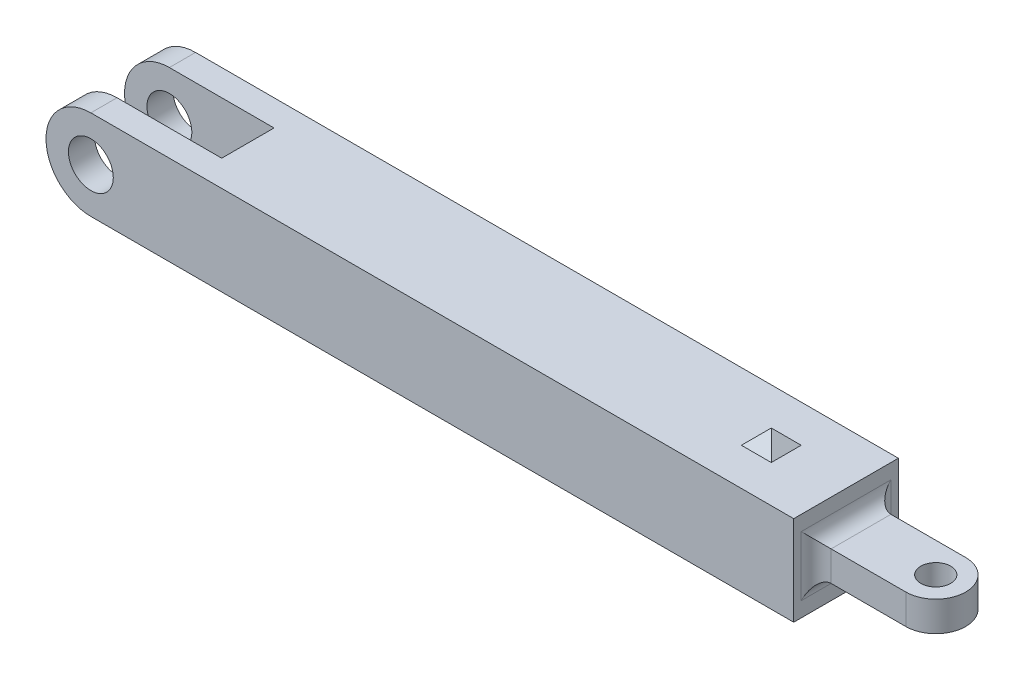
ISO-10303-21;
HEADER;
FILE_DESCRIPTION(('STEP AP214'),'2;1');
FILE_NAME('part.step','',(''),(''),'','','');
FILE_SCHEMA(('AUTOMOTIVE_DESIGN { 1 0 10303 214 1 1 1 1 }'));
ENDSEC;
DATA;
#1=APPLICATION_CONTEXT('core data for automotive mechanical design processes');
#2=APPLICATION_PROTOCOL_DEFINITION('international standard','automotive_design',2000,#1);
#3=PRODUCT_CONTEXT('',#1,'mechanical');
#4=PRODUCT('Part','Part','',(#3));
#5=PRODUCT_RELATED_PRODUCT_CATEGORY('part','',(#4));
#6=PRODUCT_DEFINITION_FORMATION('','',#4);
#7=PRODUCT_DEFINITION_CONTEXT('part definition',#1,'design');
#8=PRODUCT_DEFINITION('design','',#6,#7);
#9=PRODUCT_DEFINITION_SHAPE('','',#8);
#10=(LENGTH_UNIT() NAMED_UNIT(*) SI_UNIT(.MILLI.,.METRE.));
#11=(NAMED_UNIT(*) PLANE_ANGLE_UNIT() SI_UNIT($,.RADIAN.));
#12=(NAMED_UNIT(*) SI_UNIT($,.STERADIAN.) SOLID_ANGLE_UNIT());
#13=UNCERTAINTY_MEASURE_WITH_UNIT(LENGTH_MEASURE(1.E-05),#10,'distance_accuracy_value','');
#14=(GEOMETRIC_REPRESENTATION_CONTEXT(3) GLOBAL_UNCERTAINTY_ASSIGNED_CONTEXT((#13)) GLOBAL_UNIT_ASSIGNED_CONTEXT((#10,
#11,#12)) REPRESENTATION_CONTEXT('',''));
#15=CARTESIAN_POINT('',(0.,0.,0.));
#16=DIRECTION('',(0.,0.,1.));
#17=DIRECTION('',(1.,0.,0.));
#18=AXIS2_PLACEMENT_3D('',#15,#16,#17);
#19=CARTESIAN_POINT('',(0.,-6.,7.));
#20=DIRECTION('',(0.,1.,0.));
#21=DIRECTION('',(-1.,0.,0.));
#22=AXIS2_PLACEMENT_3D('',#19,#20,#21);
#23=PLANE('',#22);
#24=DIRECTION('',(0.,0.,-1.));
#25=VECTOR('',#24,1.);
#26=CARTESIAN_POINT('',(-80.,-6.00000000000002,-3.49999999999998));
#27=LINE('',#26,#25);
#28=CARTESIAN_POINT('',(-80.,-6.00000000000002,3.5));
#29=VERTEX_POINT('',#28);
#30=CARTESIAN_POINT('',(-80.,-6.00000000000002,-3.49999999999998));
#31=VERTEX_POINT('',#30);
#32=EDGE_CURVE('E296',#29,#31,#27,.T.);
#33=ORIENTED_EDGE('',*,*,#32,.T.);
#34=DIRECTION('',(-1.,0.,0.));
#35=VECTOR('',#34,1.);
#36=CARTESIAN_POINT('',(-100.,-6.00000000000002,-3.49999999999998));
#37=LINE('',#36,#35);
#38=CARTESIAN_POINT('',(-94.,-6.00000000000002,-3.49999999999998));
#39=VERTEX_POINT('',#38);
#40=EDGE_CURVE('E289',#31,#39,#37,.T.);
#41=ORIENTED_EDGE('',*,*,#40,.T.);
#42=DIRECTION('',(0.,0.,-1.));
#43=VECTOR('',#42,1.);
#44=CARTESIAN_POINT('',(-94.,-6.00000000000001,7.));
#45=LINE('',#44,#43);
#46=CARTESIAN_POINT('',(-94.,-6.00000000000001,-7.));
#47=VERTEX_POINT('',#46);
#48=EDGE_CURVE('E334',#39,#47,#45,.T.);
#49=ORIENTED_EDGE('',*,*,#48,.T.);
#50=DIRECTION('',(1.,0.,0.));
#51=VECTOR('',#50,1.);
#52=CARTESIAN_POINT('',(0.,-6.,-7.));
#53=LINE('',#52,#51);
#54=CARTESIAN_POINT('',(0.,-6.,-7.));
#55=VERTEX_POINT('',#54);
#56=EDGE_CURVE('E320',#47,#55,#53,.T.);
#57=ORIENTED_EDGE('',*,*,#56,.T.);
#58=DIRECTION('',(0.,0.,-1.));
#59=VECTOR('',#58,1.);
#60=CARTESIAN_POINT('',(0.,-6.,7.));
#61=LINE('',#60,#59);
#62=CARTESIAN_POINT('',(0.,-6.,7.));
#63=VERTEX_POINT('',#62);
#64=EDGE_CURVE('E355',#63,#55,#61,.T.);
#65=ORIENTED_EDGE('',*,*,#64,.F.);
#66=DIRECTION('',(1.,0.,0.));
#67=VECTOR('',#66,1.);
#68=CARTESIAN_POINT('',(0.,-6.,7.));
#69=LINE('',#68,#67);
#70=CARTESIAN_POINT('',(-94.,-6.00000000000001,7.));
#71=VERTEX_POINT('',#70);
#72=EDGE_CURVE('E323',#71,#63,#69,.T.);
#73=ORIENTED_EDGE('',*,*,#72,.F.);
#74=CARTESIAN_POINT('',(-94.,-6.00000000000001,3.5));
#75=VERTEX_POINT('',#74);
#76=EDGE_CURVE('E345',#71,#75,#45,.T.);
#77=ORIENTED_EDGE('',*,*,#76,.T.);
#78=DIRECTION('',(1.,0.,0.));
#79=VECTOR('',#78,1.);
#80=CARTESIAN_POINT('',(-80.,-6.00000000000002,3.5));
#81=LINE('',#80,#79);
#82=EDGE_CURVE('E292',#75,#29,#81,.T.);
#83=ORIENTED_EDGE('',*,*,#82,.T.);
#84=EDGE_LOOP('',(#33,#41,#49,#57,#65,#73,#77,#83));
#85=FACE_BOUND('',#84,.T.);
#86=DIRECTION('',(0.,0.,1.));
#87=VECTOR('',#86,1.);
#88=CARTESIAN_POINT('',(-8.,-6.,-2.));
#89=LINE('',#88,#87);
#90=CARTESIAN_POINT('',(-8.,-6.,-2.));
#91=VERTEX_POINT('',#90);
#92=CARTESIAN_POINT('',(-8.,-6.,2.));
#93=VERTEX_POINT('',#92);
#94=EDGE_CURVE('E208',#91,#93,#89,.T.);
#95=ORIENTED_EDGE('',*,*,#94,.F.);
#96=DIRECTION('',(1.,0.,0.));
#97=VECTOR('',#96,1.);
#98=CARTESIAN_POINT('',(-12.,-6.,-2.));
#99=LINE('',#98,#97);
#100=CARTESIAN_POINT('',(-12.,-6.,-2.));
#101=VERTEX_POINT('',#100);
#102=EDGE_CURVE('E239',#101,#91,#99,.T.);
#103=ORIENTED_EDGE('',*,*,#102,.F.);
#104=DIRECTION('',(0.,0.,-1.));
#105=VECTOR('',#104,1.);
#106=CARTESIAN_POINT('',(-12.,-6.,-2.));
#107=LINE('',#106,#105);
#108=CARTESIAN_POINT('',(-12.,-6.,2.));
#109=VERTEX_POINT('',#108);
#110=EDGE_CURVE('E235',#109,#101,#107,.T.);
#111=ORIENTED_EDGE('',*,*,#110,.F.);
#112=DIRECTION('',(-1.,0.,0.));
#113=VECTOR('',#112,1.);
#114=CARTESIAN_POINT('',(-12.,-6.,2.));
#115=LINE('',#114,#113);
#116=EDGE_CURVE('E91',#93,#109,#115,.T.);
#117=ORIENTED_EDGE('',*,*,#116,.F.);
#118=EDGE_LOOP('',(#95,#103,#111,#117));
#119=FACE_BOUND('',#118,.T.);
#120=ADVANCED_FACE('F63',(#85,#119),#23,.F.);
#121=CARTESIAN_POINT('',(16.,-2.,-4.));
#122=DIRECTION('',(0.,0.,1.));
#123=DIRECTION('',(1.,0.,0.));
#124=AXIS2_PLACEMENT_3D('',#121,#122,#123);
#125=PLANE('',#124);
#126=DIRECTION('',(-1.,0.,0.));
#127=VECTOR('',#126,1.);
#128=CARTESIAN_POINT('',(16.,-2.,-4.));
#129=LINE('',#128,#127);
#130=CARTESIAN_POINT('',(12.,-2.,-4.));
#131=VERTEX_POINT('',#130);
#132=CARTESIAN_POINT('',(2.,-2.,-4.));
#133=VERTEX_POINT('',#132);
#134=EDGE_CURVE('E276',#131,#133,#129,.T.);
#135=ORIENTED_EDGE('',*,*,#134,.T.);
#136=DIRECTION('',(0.,1.,0.));
#137=VECTOR('',#136,1.);
#138=CARTESIAN_POINT('',(2.,2.,-4.));
#139=LINE('',#138,#137);
#140=CARTESIAN_POINT('',(2.,2.,-4.));
#141=VERTEX_POINT('',#140);
#142=EDGE_CURVE('E72',#133,#141,#139,.T.);
#143=ORIENTED_EDGE('',*,*,#142,.T.);
#144=DIRECTION('',(-1.,0.,0.));
#145=VECTOR('',#144,1.);
#146=CARTESIAN_POINT('',(16.,2.,-4.));
#147=LINE('',#146,#145);
#148=CARTESIAN_POINT('',(12.,2.,-4.));
#149=VERTEX_POINT('',#148);
#150=EDGE_CURVE('E285',#149,#141,#147,.T.);
#151=ORIENTED_EDGE('',*,*,#150,.F.);
#152=DIRECTION('',(0.,-1.,0.));
#153=VECTOR('',#152,1.);
#154=CARTESIAN_POINT('',(12.,6.00000000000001,-4.));
#155=LINE('',#154,#153);
#156=EDGE_CURVE('E264',#149,#131,#155,.T.);
#157=ORIENTED_EDGE('',*,*,#156,.T.);
#158=EDGE_LOOP('',(#135,#143,#151,#157));
#159=FACE_BOUND('',#158,.T.);
#160=ADVANCED_FACE('F418',(#159),#125,.F.);
#161=CARTESIAN_POINT('',(0.,-6.,7.));
#162=DIRECTION('',(-1.,0.,0.));
#163=DIRECTION('',(0.,-1.,0.));
#164=AXIS2_PLACEMENT_3D('',#161,#162,#163);
#165=PLANE('',#164);
#166=DIRECTION('',(0.,0.,-1.));
#167=VECTOR('',#166,1.);
#168=CARTESIAN_POINT('',(0.,-4.,4.));
#169=LINE('',#168,#167);
#170=CARTESIAN_POINT('',(0.,-4.,-6.));
#171=VERTEX_POINT('',#170);
#172=CARTESIAN_POINT('',(0.,-4.,6.));
#173=VERTEX_POINT('',#172);
#174=EDGE_CURVE('E365',#171,#173,#169,.F.);
#175=ORIENTED_EDGE('',*,*,#174,.T.);
#176=DIRECTION('',(0.,-1.,0.));
#177=VECTOR('',#176,1.);
#178=CARTESIAN_POINT('',(0.,2.,6.));
#179=LINE('',#178,#177);
#180=CARTESIAN_POINT('',(0.,4.,6.));
#181=VERTEX_POINT('',#180);
#182=EDGE_CURVE('E371',#173,#181,#179,.F.);
#183=ORIENTED_EDGE('',*,*,#182,.T.);
#184=DIRECTION('',(0.,0.,1.));
#185=VECTOR('',#184,1.);
#186=CARTESIAN_POINT('',(0.,4.,-4.));
#187=LINE('',#186,#185);
#188=CARTESIAN_POINT('',(0.,4.,-6.));
#189=VERTEX_POINT('',#188);
#190=EDGE_CURVE('E369',#181,#189,#187,.F.);
#191=ORIENTED_EDGE('',*,*,#190,.T.);
#192=DIRECTION('',(0.,1.,0.));
#193=VECTOR('',#192,1.);
#194=CARTESIAN_POINT('',(0.,-2.,-6.));
#195=LINE('',#194,#193);
#196=EDGE_CURVE('E367',#189,#171,#195,.F.);
#197=ORIENTED_EDGE('',*,*,#196,.T.);
#198=EDGE_LOOP('',(#175,#183,#191,#197));
#199=FACE_BOUND('',#198,.T.);
#200=DIRECTION('',(0.,1.,0.));
#201=VECTOR('',#200,1.);
#202=CARTESIAN_POINT('',(0.,-6.,-7.));
#203=LINE('',#202,#201);
#204=CARTESIAN_POINT('',(0.,6.,-7.));
#205=VERTEX_POINT('',#204);
#206=EDGE_CURVE('E338',#55,#205,#203,.T.);
#207=ORIENTED_EDGE('',*,*,#206,.T.);
#208=DIRECTION('',(0.,0.,-1.));
#209=VECTOR('',#208,1.);
#210=CARTESIAN_POINT('',(0.,6.,7.));
#211=LINE('',#210,#209);
#212=CARTESIAN_POINT('',(0.,6.,7.));
#213=VERTEX_POINT('',#212);
#214=EDGE_CURVE('E352',#213,#205,#211,.T.);
#215=ORIENTED_EDGE('',*,*,#214,.F.);
#216=DIRECTION('',(0.,1.,0.));
#217=VECTOR('',#216,1.);
#218=CARTESIAN_POINT('',(0.,-6.,7.));
#219=LINE('',#218,#217);
#220=EDGE_CURVE('E327',#63,#213,#219,.T.);
#221=ORIENTED_EDGE('',*,*,#220,.F.);
#222=ORIENTED_EDGE('',*,*,#64,.T.);
#223=EDGE_LOOP('',(#207,#215,#221,#222));
#224=FACE_BOUND('',#223,.T.);
#225=ADVANCED_FACE('F396',(#199,#224),#165,.F.);
#226=CARTESIAN_POINT('',(-94.,0.,7.));
#227=DIRECTION('',(0.,0.,-1.));
#228=DIRECTION('',(-1.,0.,0.));
#229=AXIS2_PLACEMENT_3D('',#226,#227,#228);
#230=CYLINDRICAL_SURFACE('',#229,6.);
#231=CARTESIAN_POINT('',(-94.,0.,-3.49999999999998));
#232=DIRECTION('',(0.,0.,-1.));
#233=DIRECTION('',(-1.,0.,0.));
#234=AXIS2_PLACEMENT_3D('',#231,#232,#233);
#235=CIRCLE('',#234,6.);
#236=CARTESIAN_POINT('',(-94.,5.99999999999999,-3.49999999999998));
#237=VERTEX_POINT('',#236);
#238=EDGE_CURVE('E314',#39,#237,#235,.T.);
#239=ORIENTED_EDGE('',*,*,#238,.T.);
#240=DIRECTION('',(0.,0.,-1.));
#241=VECTOR('',#240,1.);
#242=CARTESIAN_POINT('',(-94.,5.99999999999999,7.));
#243=LINE('',#242,#241);
#244=CARTESIAN_POINT('',(-94.,5.99999999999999,-7.));
#245=VERTEX_POINT('',#244);
#246=EDGE_CURVE('E348',#237,#245,#243,.T.);
#247=ORIENTED_EDGE('',*,*,#246,.T.);
#248=CARTESIAN_POINT('',(-94.,0.,-7.));
#249=DIRECTION('',(0.,0.,1.));
#250=DIRECTION('',(1.,0.,0.));
#251=AXIS2_PLACEMENT_3D('',#248,#249,#250);
#252=CIRCLE('',#251,6.);
#253=EDGE_CURVE('E328',#245,#47,#252,.T.);
#254=ORIENTED_EDGE('',*,*,#253,.T.);
#255=ORIENTED_EDGE('',*,*,#48,.F.);
#256=EDGE_LOOP('',(#239,#247,#254,#255));
#257=FACE_BOUND('',#256,.T.);
#258=ADVANCED_FACE('F424',(#257),#230,.T.);
#259=CARTESIAN_POINT('',(-94.,0.,7.));
#260=DIRECTION('',(0.,0.,-1.));
#261=DIRECTION('',(-1.,0.,0.));
#262=AXIS2_PLACEMENT_3D('',#259,#260,#261);
#263=CYLINDRICAL_SURFACE('',#262,3.00000000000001);
#264=CARTESIAN_POINT('',(-94.,0.,-3.49999999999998));
#265=DIRECTION('',(0.,0.,-1.));
#266=DIRECTION('',(-1.,0.,0.));
#267=AXIS2_PLACEMENT_3D('',#264,#265,#266);
#268=CIRCLE('',#267,3.00000000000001);
#269=CARTESIAN_POINT('',(-97.,0.,-3.49999999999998));
#270=VERTEX_POINT('',#269);
#271=EDGE_CURVE('E313',#270,#270,#268,.T.);
#272=ORIENTED_EDGE('',*,*,#271,.F.);
#273=EDGE_LOOP('',(#272));
#274=FACE_BOUND('',#273,.T.);
#275=CARTESIAN_POINT('',(-94.,0.,-7.));
#276=DIRECTION('',(0.,0.,1.));
#277=DIRECTION('',(1.,0.,0.));
#278=AXIS2_PLACEMENT_3D('',#275,#276,#277);
#279=CIRCLE('',#278,3.00000000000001);
#280=CARTESIAN_POINT('',(-91.,0.,-7.));
#281=VERTEX_POINT('',#280);
#282=EDGE_CURVE('E316',#281,#281,#279,.T.);
#283=ORIENTED_EDGE('',*,*,#282,.F.);
#284=EDGE_LOOP('',(#283));
#285=FACE_BOUND('',#284,.T.);
#286=ADVANCED_FACE('F449',(#274,#285),#263,.F.);
#287=CARTESIAN_POINT('',(-94.,0.,7.));
#288=DIRECTION('',(0.,0.,1.));
#289=DIRECTION('',(1.,0.,0.));
#290=AXIS2_PLACEMENT_3D('',#287,#288,#289);
#291=PLANE('',#290);
#292=ORIENTED_EDGE('',*,*,#72,.T.);
#293=ORIENTED_EDGE('',*,*,#220,.T.);
#294=DIRECTION('',(-1.,0.,0.));
#295=VECTOR('',#294,1.);
#296=CARTESIAN_POINT('',(0.,6.,7.));
#297=LINE('',#296,#295);
#298=CARTESIAN_POINT('',(-94.,5.99999999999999,7.));
#299=VERTEX_POINT('',#298);
#300=EDGE_CURVE('E330',#213,#299,#297,.T.);
#301=ORIENTED_EDGE('',*,*,#300,.T.);
#302=CARTESIAN_POINT('',(-94.,0.,7.));
#303=DIRECTION('',(0.,0.,1.));
#304=DIRECTION('',(1.,0.,0.));
#305=AXIS2_PLACEMENT_3D('',#302,#303,#304);
#306=CIRCLE('',#305,6.);
#307=EDGE_CURVE('E332',#299,#71,#306,.T.);
#308=ORIENTED_EDGE('',*,*,#307,.T.);
#309=EDGE_LOOP('',(#292,#293,#301,#308));
#310=FACE_BOUND('',#309,.T.);
#311=CARTESIAN_POINT('',(-94.,0.,7.));
#312=DIRECTION('',(0.,0.,1.));
#313=DIRECTION('',(1.,0.,0.));
#314=AXIS2_PLACEMENT_3D('',#311,#312,#313);
#315=CIRCLE('',#314,3.00000000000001);
#316=CARTESIAN_POINT('',(-91.,0.,7.));
#317=VERTEX_POINT('',#316);
#318=EDGE_CURVE('E317',#317,#317,#315,.T.);
#319=ORIENTED_EDGE('',*,*,#318,.F.);
#320=EDGE_LOOP('',(#319));
#321=FACE_BOUND('',#320,.T.);
#322=ADVANCED_FACE('F450',(#310,#321),#291,.T.);
#323=CARTESIAN_POINT('',(-94.,0.,-7.));
#324=DIRECTION('',(0.,0.,1.));
#325=DIRECTION('',(1.,0.,0.));
#326=AXIS2_PLACEMENT_3D('',#323,#324,#325);
#327=PLANE('',#326);
#328=ORIENTED_EDGE('',*,*,#56,.F.);
#329=ORIENTED_EDGE('',*,*,#253,.F.);
#330=DIRECTION('',(-1.,0.,0.));
#331=VECTOR('',#330,1.);
#332=CARTESIAN_POINT('',(0.,6.,-7.));
#333=LINE('',#332,#331);
#334=EDGE_CURVE('E340',#205,#245,#333,.T.);
#335=ORIENTED_EDGE('',*,*,#334,.F.);
#336=ORIENTED_EDGE('',*,*,#206,.F.);
#337=EDGE_LOOP('',(#328,#329,#335,#336));
#338=FACE_BOUND('',#337,.T.);
#339=ORIENTED_EDGE('',*,*,#282,.T.);
#340=EDGE_LOOP('',(#339));
#341=FACE_BOUND('',#340,.T.);
#342=ADVANCED_FACE('F453',(#338,#341),#327,.F.);
#343=CARTESIAN_POINT('',(0.,6.,7.));
#344=DIRECTION('',(0.,-1.,0.));
#345=DIRECTION('',(1.,0.,0.));
#346=AXIS2_PLACEMENT_3D('',#343,#344,#345);
#347=PLANE('',#346);
#348=DIRECTION('',(1.,0.,0.));
#349=VECTOR('',#348,1.);
#350=CARTESIAN_POINT('',(-12.,6.,-2.));
#351=LINE('',#350,#349);
#352=CARTESIAN_POINT('',(-12.,6.,-2.));
#353=VERTEX_POINT('',#352);
#354=CARTESIAN_POINT('',(-8.,6.,-2.));
#355=VERTEX_POINT('',#354);
#356=EDGE_CURVE('E205',#353,#355,#351,.T.);
#357=ORIENTED_EDGE('',*,*,#356,.T.);
#358=DIRECTION('',(0.,0.,1.));
#359=VECTOR('',#358,1.);
#360=CARTESIAN_POINT('',(-8.,6.,-2.));
#361=LINE('',#360,#359);
#362=CARTESIAN_POINT('',(-8.,6.,2.));
#363=VERTEX_POINT('',#362);
#364=EDGE_CURVE('E211',#355,#363,#361,.T.);
#365=ORIENTED_EDGE('',*,*,#364,.T.);
#366=DIRECTION('',(-1.,0.,0.));
#367=VECTOR('',#366,1.);
#368=CARTESIAN_POINT('',(-12.,6.,2.));
#369=LINE('',#368,#367);
#370=CARTESIAN_POINT('',(-12.,6.,2.));
#371=VERTEX_POINT('',#370);
#372=EDGE_CURVE('E222',#363,#371,#369,.T.);
#373=ORIENTED_EDGE('',*,*,#372,.T.);
#374=DIRECTION('',(0.,0.,-1.));
#375=VECTOR('',#374,1.);
#376=CARTESIAN_POINT('',(-12.,6.,-2.));
#377=LINE('',#376,#375);
#378=EDGE_CURVE('E80',#371,#353,#377,.T.);
#379=ORIENTED_EDGE('',*,*,#378,.T.);
#380=EDGE_LOOP('',(#357,#365,#373,#379));
#381=FACE_BOUND('',#380,.T.);
#382=ORIENTED_EDGE('',*,*,#246,.F.);
#383=DIRECTION('',(-1.,0.,0.));
#384=VECTOR('',#383,1.);
#385=CARTESIAN_POINT('',(-100.,5.99999999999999,-3.49999999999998));
#386=LINE('',#385,#384);
#387=CARTESIAN_POINT('',(-80.,5.99999999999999,-3.49999999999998));
#388=VERTEX_POINT('',#387);
#389=EDGE_CURVE('E288',#388,#237,#386,.T.);
#390=ORIENTED_EDGE('',*,*,#389,.F.);
#391=DIRECTION('',(0.,0.,-1.));
#392=VECTOR('',#391,1.);
#393=CARTESIAN_POINT('',(-80.,5.99999999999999,-3.49999999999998));
#394=LINE('',#393,#392);
#395=CARTESIAN_POINT('',(-80.,5.99999999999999,3.5));
#396=VERTEX_POINT('',#395);
#397=EDGE_CURVE('E293',#396,#388,#394,.T.);
#398=ORIENTED_EDGE('',*,*,#397,.F.);
#399=DIRECTION('',(1.,0.,0.));
#400=VECTOR('',#399,1.);
#401=CARTESIAN_POINT('',(-80.,5.99999999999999,3.5));
#402=LINE('',#401,#400);
#403=CARTESIAN_POINT('',(-94.,5.99999999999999,3.5));
#404=VERTEX_POINT('',#403);
#405=EDGE_CURVE('E302',#404,#396,#402,.T.);
#406=ORIENTED_EDGE('',*,*,#405,.F.);
#407=EDGE_CURVE('E349',#299,#404,#243,.T.);
#408=ORIENTED_EDGE('',*,*,#407,.F.);
#409=ORIENTED_EDGE('',*,*,#300,.F.);
#410=ORIENTED_EDGE('',*,*,#214,.T.);
#411=ORIENTED_EDGE('',*,*,#334,.T.);
#412=EDGE_LOOP('',(#382,#390,#398,#406,#408,#409,#410,#411));
#413=FACE_BOUND('',#412,.T.);
#414=ADVANCED_FACE('F219',(#381,#413),#347,.F.);
#415=ORIENTED_EDGE('',*,*,#407,.T.);
#416=CARTESIAN_POINT('',(-94.,0.,3.5));
#417=DIRECTION('',(0.,0.,1.));
#418=DIRECTION('',(1.,0.,0.));
#419=AXIS2_PLACEMENT_3D('',#416,#417,#418);
#420=CIRCLE('',#419,6.);
#421=EDGE_CURVE('E311',#404,#75,#420,.T.);
#422=ORIENTED_EDGE('',*,*,#421,.T.);
#423=ORIENTED_EDGE('',*,*,#76,.F.);
#424=ORIENTED_EDGE('',*,*,#307,.F.);
#425=EDGE_LOOP('',(#415,#422,#423,#424));
#426=FACE_BOUND('',#425,.T.);
#427=ADVANCED_FACE('F447',(#426),#230,.T.);
#428=CARTESIAN_POINT('',(-94.,0.,3.5));
#429=DIRECTION('',(0.,0.,1.));
#430=DIRECTION('',(1.,0.,0.));
#431=AXIS2_PLACEMENT_3D('',#428,#429,#430);
#432=CIRCLE('',#431,3.00000000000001);
#433=CARTESIAN_POINT('',(-91.,0.,3.5));
#434=VERTEX_POINT('',#433);
#435=EDGE_CURVE('E308',#434,#434,#432,.T.);
#436=ORIENTED_EDGE('',*,*,#435,.F.);
#437=EDGE_LOOP('',(#436));
#438=FACE_BOUND('',#437,.T.);
#439=ORIENTED_EDGE('',*,*,#318,.T.);
#440=EDGE_LOOP('',(#439));
#441=FACE_BOUND('',#440,.T.);
#442=ADVANCED_FACE('F443',(#438,#441),#263,.F.);
#443=CARTESIAN_POINT('',(-100.,-6.00000000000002,-3.49999999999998));
#444=DIRECTION('',(0.,0.,-1.));
#445=DIRECTION('',(-1.,0.,0.));
#446=AXIS2_PLACEMENT_3D('',#443,#444,#445);
#447=PLANE('',#446);
#448=ORIENTED_EDGE('',*,*,#271,.T.);
#449=EDGE_LOOP('',(#448));
#450=FACE_BOUND('',#449,.T.);
#451=ORIENTED_EDGE('',*,*,#238,.F.);
#452=ORIENTED_EDGE('',*,*,#40,.F.);
#453=DIRECTION('',(0.,1.,0.));
#454=VECTOR('',#453,1.);
#455=CARTESIAN_POINT('',(-80.,-6.00000000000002,-3.49999999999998));
#456=LINE('',#455,#454);
#457=EDGE_CURVE('E306',#31,#388,#456,.T.);
#458=ORIENTED_EDGE('',*,*,#457,.T.);
#459=ORIENTED_EDGE('',*,*,#389,.T.);
#460=EDGE_LOOP('',(#451,#452,#458,#459));
#461=FACE_BOUND('',#460,.T.);
#462=ADVANCED_FACE('F439',(#450,#461),#447,.F.);
#463=CARTESIAN_POINT('',(-80.,-6.00000000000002,3.5));
#464=DIRECTION('',(0.,0.,1.));
#465=DIRECTION('',(1.,0.,0.));
#466=AXIS2_PLACEMENT_3D('',#463,#464,#465);
#467=PLANE('',#466);
#468=ORIENTED_EDGE('',*,*,#435,.T.);
#469=EDGE_LOOP('',(#468));
#470=FACE_BOUND('',#469,.T.);
#471=ORIENTED_EDGE('',*,*,#405,.T.);
#472=DIRECTION('',(0.,1.,0.));
#473=VECTOR('',#472,1.);
#474=CARTESIAN_POINT('',(-80.,-6.00000000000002,3.5));
#475=LINE('',#474,#473);
#476=EDGE_CURVE('E299',#29,#396,#475,.T.);
#477=ORIENTED_EDGE('',*,*,#476,.F.);
#478=ORIENTED_EDGE('',*,*,#82,.F.);
#479=ORIENTED_EDGE('',*,*,#421,.F.);
#480=EDGE_LOOP('',(#471,#477,#478,#479));
#481=FACE_BOUND('',#480,.T.);
#482=ADVANCED_FACE('F435',(#470,#481),#467,.F.);
#483=CARTESIAN_POINT('',(-80.,-6.00000000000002,-3.49999999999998));
#484=DIRECTION('',(1.,0.,0.));
#485=DIRECTION('',(0.,1.,0.));
#486=AXIS2_PLACEMENT_3D('',#483,#484,#485);
#487=PLANE('',#486);
#488=ORIENTED_EDGE('',*,*,#397,.T.);
#489=ORIENTED_EDGE('',*,*,#457,.F.);
#490=ORIENTED_EDGE('',*,*,#32,.F.);
#491=ORIENTED_EDGE('',*,*,#476,.T.);
#492=EDGE_LOOP('',(#488,#489,#490,#491));
#493=FACE_BOUND('',#492,.T.);
#494=ADVANCED_FACE('F432',(#493),#487,.F.);
#495=CARTESIAN_POINT('',(16.,2.,4.));
#496=DIRECTION('',(0.,-1.,0.));
#497=DIRECTION('',(1.,0.,0.));
#498=AXIS2_PLACEMENT_3D('',#495,#496,#497);
#499=PLANE('',#498);
#500=CARTESIAN_POINT('',(12.,2.,0.));
#501=DIRECTION('',(0.,-1.,0.));
#502=DIRECTION('',(1.,0.,0.));
#503=AXIS2_PLACEMENT_3D('',#500,#501,#502);
#504=CIRCLE('',#503,2.);
#505=CARTESIAN_POINT('',(14.,2.,0.));
#506=VERTEX_POINT('',#505);
#507=EDGE_CURVE('E273',#506,#506,#504,.T.);
#508=ORIENTED_EDGE('',*,*,#507,.T.);
#509=EDGE_LOOP('',(#508));
#510=FACE_BOUND('',#509,.T.);
#511=ORIENTED_EDGE('',*,*,#150,.T.);
#512=DIRECTION('',(0.,0.,1.));
#513=VECTOR('',#512,1.);
#514=CARTESIAN_POINT('',(2.,2.,4.));
#515=LINE('',#514,#513);
#516=CARTESIAN_POINT('',(2.,2.,4.));
#517=VERTEX_POINT('',#516);
#518=EDGE_CURVE('E374',#141,#517,#515,.T.);
#519=ORIENTED_EDGE('',*,*,#518,.T.);
#520=DIRECTION('',(-1.,0.,0.));
#521=VECTOR('',#520,1.);
#522=CARTESIAN_POINT('',(16.,2.,4.));
#523=LINE('',#522,#521);
#524=CARTESIAN_POINT('',(12.,2.,4.));
#525=VERTEX_POINT('',#524);
#526=EDGE_CURVE('E282',#525,#517,#523,.T.);
#527=ORIENTED_EDGE('',*,*,#526,.F.);
#528=CARTESIAN_POINT('',(12.,2.,0.));
#529=DIRECTION('',(0.,-1.,0.));
#530=DIRECTION('',(1.,0.,0.));
#531=AXIS2_PLACEMENT_3D('',#528,#529,#530);
#532=CIRCLE('',#531,4.);
#533=EDGE_CURVE('E267',#525,#149,#532,.F.);
#534=ORIENTED_EDGE('',*,*,#533,.T.);
#535=EDGE_LOOP('',(#511,#519,#527,#534));
#536=FACE_BOUND('',#535,.T.);
#537=ADVANCED_FACE('F415',(#510,#536),#499,.F.);
#538=CARTESIAN_POINT('',(16.,-2.,4.));
#539=DIRECTION('',(0.,0.,-1.));
#540=DIRECTION('',(-1.,0.,0.));
#541=AXIS2_PLACEMENT_3D('',#538,#539,#540);
#542=PLANE('',#541);
#543=ORIENTED_EDGE('',*,*,#526,.T.);
#544=DIRECTION('',(0.,-1.,0.));
#545=VECTOR('',#544,1.);
#546=CARTESIAN_POINT('',(2.,-2.,4.));
#547=LINE('',#546,#545);
#548=CARTESIAN_POINT('',(2.,-2.,4.));
#549=VERTEX_POINT('',#548);
#550=EDGE_CURVE('E358',#517,#549,#547,.T.);
#551=ORIENTED_EDGE('',*,*,#550,.T.);
#552=DIRECTION('',(-1.,0.,0.));
#553=VECTOR('',#552,1.);
#554=CARTESIAN_POINT('',(16.,-2.,4.));
#555=LINE('',#554,#553);
#556=CARTESIAN_POINT('',(12.,-2.,4.));
#557=VERTEX_POINT('',#556);
#558=EDGE_CURVE('E279',#557,#549,#555,.T.);
#559=ORIENTED_EDGE('',*,*,#558,.F.);
#560=DIRECTION('',(0.,-1.,0.));
#561=VECTOR('',#560,1.);
#562=CARTESIAN_POINT('',(12.,6.00000000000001,4.));
#563=LINE('',#562,#561);
#564=EDGE_CURVE('E259',#525,#557,#563,.T.);
#565=ORIENTED_EDGE('',*,*,#564,.F.);
#566=EDGE_LOOP('',(#543,#551,#559,#565));
#567=FACE_BOUND('',#566,.T.);
#568=ADVANCED_FACE('F408',(#567),#542,.F.);
#569=CARTESIAN_POINT('',(16.,-2.,4.));
#570=DIRECTION('',(0.,1.,0.));
#571=DIRECTION('',(-1.,0.,0.));
#572=AXIS2_PLACEMENT_3D('',#569,#570,#571);
#573=PLANE('',#572);
#574=CARTESIAN_POINT('',(12.,-2.,0.));
#575=DIRECTION('',(0.,-1.,0.));
#576=DIRECTION('',(1.,0.,0.));
#577=AXIS2_PLACEMENT_3D('',#574,#575,#576);
#578=CIRCLE('',#577,2.);
#579=CARTESIAN_POINT('',(14.,-2.,0.));
#580=VERTEX_POINT('',#579);
#581=EDGE_CURVE('E270',#580,#580,#578,.T.);
#582=ORIENTED_EDGE('',*,*,#581,.F.);
#583=EDGE_LOOP('',(#582));
#584=FACE_BOUND('',#583,.T.);
#585=ORIENTED_EDGE('',*,*,#558,.T.);
#586=DIRECTION('',(0.,0.,-1.));
#587=VECTOR('',#586,1.);
#588=CARTESIAN_POINT('',(2.,-2.,-4.));
#589=LINE('',#588,#587);
#590=EDGE_CURVE('E12',#549,#133,#589,.T.);
#591=ORIENTED_EDGE('',*,*,#590,.T.);
#592=ORIENTED_EDGE('',*,*,#134,.F.);
#593=CARTESIAN_POINT('',(12.,-2.,0.));
#594=DIRECTION('',(0.,-1.,0.));
#595=DIRECTION('',(1.,0.,0.));
#596=AXIS2_PLACEMENT_3D('',#593,#594,#595);
#597=CIRCLE('',#596,4.);
#598=EDGE_CURVE('E262',#557,#131,#597,.F.);
#599=ORIENTED_EDGE('',*,*,#598,.F.);
#600=EDGE_LOOP('',(#585,#591,#592,#599));
#601=FACE_BOUND('',#600,.T.);
#602=ADVANCED_FACE('F411',(#584,#601),#573,.F.);
#603=CARTESIAN_POINT('',(12.,6.00000000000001,0.));
#604=DIRECTION('',(0.,-1.,0.));
#605=DIRECTION('',(1.,0.,0.));
#606=AXIS2_PLACEMENT_3D('',#603,#604,#605);
#607=CYLINDRICAL_SURFACE('',#606,2.);
#608=ORIENTED_EDGE('',*,*,#581,.T.);
#609=EDGE_LOOP('',(#608));
#610=FACE_BOUND('',#609,.T.);
#611=ORIENTED_EDGE('',*,*,#507,.F.);
#612=EDGE_LOOP('',(#611));
#613=FACE_BOUND('',#612,.T.);
#614=ADVANCED_FACE('F474',(#610,#613),#607,.F.);
#615=CARTESIAN_POINT('',(12.,6.00000000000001,0.));
#616=DIRECTION('',(0.,-1.,0.));
#617=DIRECTION('',(1.,0.,0.));
#618=AXIS2_PLACEMENT_3D('',#615,#616,#617);
#619=CYLINDRICAL_SURFACE('',#618,4.);
#620=ORIENTED_EDGE('',*,*,#533,.F.);
#621=ORIENTED_EDGE('',*,*,#564,.T.);
#622=ORIENTED_EDGE('',*,*,#598,.T.);
#623=ORIENTED_EDGE('',*,*,#156,.F.);
#624=EDGE_LOOP('',(#620,#621,#622,#623));
#625=FACE_BOUND('',#624,.T.);
#626=ADVANCED_FACE('F413',(#625),#619,.T.);
#627=CARTESIAN_POINT('',(2.,-2.,-6.));
#628=DIRECTION('',(0.,-1.,0.));
#629=DIRECTION('',(1.,0.,0.));
#630=AXIS2_PLACEMENT_3D('',#627,#628,#629);
#631=CYLINDRICAL_SURFACE('',#630,2.);
#632=CARTESIAN_POINT('',(2.,-4.,-6.));
#633=DIRECTION('',(0.,-0.707106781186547,0.707106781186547));
#634=DIRECTION('',(0.,0.707106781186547,0.707106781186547));
#635=AXIS2_PLACEMENT_3D('',#632,#633,#634);
#636=ELLIPSE('',#635,2.82842712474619,2.);
#637=EDGE_CURVE('E379',#171,#133,#636,.F.);
#638=ORIENTED_EDGE('',*,*,#637,.F.);
#639=ORIENTED_EDGE('',*,*,#196,.F.);
#640=CARTESIAN_POINT('',(2.,4.,-6.));
#641=DIRECTION('',(0.,-0.707106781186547,-0.707106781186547));
#642=DIRECTION('',(0.,-0.707106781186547,0.707106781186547));
#643=AXIS2_PLACEMENT_3D('',#640,#641,#642);
#644=ELLIPSE('',#643,2.82842712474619,2.);
#645=EDGE_CURVE('E67',#141,#189,#644,.T.);
#646=ORIENTED_EDGE('',*,*,#645,.F.);
#647=ORIENTED_EDGE('',*,*,#142,.F.);
#648=EDGE_LOOP('',(#638,#639,#646,#647));
#649=FACE_BOUND('',#648,.T.);
#650=ADVANCED_FACE('F65',(#649),#631,.F.);
#651=CARTESIAN_POINT('',(2.,4.,4.));
#652=DIRECTION('',(0.,0.,-1.));
#653=DIRECTION('',(-1.,0.,0.));
#654=AXIS2_PLACEMENT_3D('',#651,#652,#653);
#655=CYLINDRICAL_SURFACE('',#654,2.);
#656=ORIENTED_EDGE('',*,*,#645,.T.);
#657=ORIENTED_EDGE('',*,*,#190,.F.);
#658=CARTESIAN_POINT('',(2.,4.,6.));
#659=DIRECTION('',(0.,0.707106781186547,-0.707106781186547));
#660=DIRECTION('',(0.,-0.707106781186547,-0.707106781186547));
#661=AXIS2_PLACEMENT_3D('',#658,#659,#660);
#662=ELLIPSE('',#661,2.82842712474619,2.);
#663=EDGE_CURVE('E378',#517,#181,#662,.T.);
#664=ORIENTED_EDGE('',*,*,#663,.F.);
#665=ORIENTED_EDGE('',*,*,#518,.F.);
#666=EDGE_LOOP('',(#656,#657,#664,#665));
#667=FACE_BOUND('',#666,.T.);
#668=ADVANCED_FACE('F390',(#667),#655,.F.);
#669=CARTESIAN_POINT('',(2.,-4.,4.));
#670=DIRECTION('',(0.,0.,1.));
#671=DIRECTION('',(1.,0.,0.));
#672=AXIS2_PLACEMENT_3D('',#669,#670,#671);
#673=CYLINDRICAL_SURFACE('',#672,2.);
#674=ORIENTED_EDGE('',*,*,#637,.T.);
#675=ORIENTED_EDGE('',*,*,#590,.F.);
#676=CARTESIAN_POINT('',(2.,-4.,6.));
#677=DIRECTION('',(0.,0.707106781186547,0.707106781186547));
#678=DIRECTION('',(0.,-0.707106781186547,0.707106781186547));
#679=AXIS2_PLACEMENT_3D('',#676,#677,#678);
#680=ELLIPSE('',#679,2.82842712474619,2.);
#681=EDGE_CURVE('E247',#173,#549,#680,.F.);
#682=ORIENTED_EDGE('',*,*,#681,.F.);
#683=ORIENTED_EDGE('',*,*,#174,.F.);
#684=EDGE_LOOP('',(#674,#675,#682,#683));
#685=FACE_BOUND('',#684,.T.);
#686=ADVANCED_FACE('F403',(#685),#673,.F.);
#687=CARTESIAN_POINT('',(2.,-2.,6.));
#688=DIRECTION('',(0.,1.,0.));
#689=DIRECTION('',(-1.,0.,0.));
#690=AXIS2_PLACEMENT_3D('',#687,#688,#689);
#691=CYLINDRICAL_SURFACE('',#690,2.);
#692=ORIENTED_EDGE('',*,*,#663,.T.);
#693=ORIENTED_EDGE('',*,*,#182,.F.);
#694=ORIENTED_EDGE('',*,*,#681,.T.);
#695=ORIENTED_EDGE('',*,*,#550,.F.);
#696=EDGE_LOOP('',(#692,#693,#694,#695));
#697=FACE_BOUND('',#696,.T.);
#698=ADVANCED_FACE('F401',(#697),#691,.F.);
#699=CARTESIAN_POINT('',(-8.,-6.,-2.));
#700=DIRECTION('',(0.707106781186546,-0.707106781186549,0.));
#701=DIRECTION('',(0.707106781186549,0.707106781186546,0.));
#702=AXIS2_PLACEMENT_3D('',#699,#700,#701);
#703=PLANE('',#702);
#704=ORIENTED_EDGE('',*,*,#94,.T.);
#705=DIRECTION('',(0.577350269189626,0.577350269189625,0.577350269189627));
#706=VECTOR('',#705,1.);
#707=CARTESIAN_POINT('',(-9.33333333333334,-7.33333333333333,0.666666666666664));
#708=LINE('',#707,#706);
#709=CARTESIAN_POINT('',(-10.,-7.99999999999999,0.));
#710=VERTEX_POINT('',#709);
#711=EDGE_CURVE('E244',#710,#93,#708,.T.);
#712=ORIENTED_EDGE('',*,*,#711,.F.);
#713=DIRECTION('',(0.577350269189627,0.577350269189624,-0.577350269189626));
#714=VECTOR('',#713,1.);
#715=CARTESIAN_POINT('',(-8.,-6.,-2.));
#716=LINE('',#715,#714);
#717=EDGE_CURVE('E243',#710,#91,#716,.T.);
#718=ORIENTED_EDGE('',*,*,#717,.T.);
#719=EDGE_LOOP('',(#704,#712,#718));
#720=FACE_BOUND('',#719,.T.);
#721=ADVANCED_FACE('F465',(#720),#703,.T.);
#722=CARTESIAN_POINT('',(-12.,-6.,2.));
#723=DIRECTION('',(0.,-0.707106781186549,0.707106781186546));
#724=DIRECTION('',(0.,-0.707106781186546,-0.707106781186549));
#725=AXIS2_PLACEMENT_3D('',#722,#723,#724);
#726=PLANE('',#725);
#727=ORIENTED_EDGE('',*,*,#116,.T.);
#728=DIRECTION('',(-0.577350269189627,0.577350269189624,0.577350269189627));
#729=VECTOR('',#728,1.);
#730=CARTESIAN_POINT('',(-10.6666666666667,-7.33333333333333,0.666666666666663));
#731=LINE('',#730,#729);
#732=EDGE_CURVE('E248',#710,#109,#731,.T.);
#733=ORIENTED_EDGE('',*,*,#732,.F.);
#734=ORIENTED_EDGE('',*,*,#711,.T.);
#735=EDGE_LOOP('',(#727,#733,#734));
#736=FACE_BOUND('',#735,.T.);
#737=ADVANCED_FACE('F482',(#736),#726,.T.);
#738=CARTESIAN_POINT('',(-12.,-6.,-2.));
#739=DIRECTION('',(-0.707106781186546,-0.707106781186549,0.));
#740=DIRECTION('',(0.707106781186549,-0.707106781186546,0.));
#741=AXIS2_PLACEMENT_3D('',#738,#739,#740);
#742=PLANE('',#741);
#743=ORIENTED_EDGE('',*,*,#110,.T.);
#744=DIRECTION('',(-0.577350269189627,0.577350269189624,-0.577350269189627));
#745=VECTOR('',#744,1.);
#746=CARTESIAN_POINT('',(-12.,-6.,-2.));
#747=LINE('',#746,#745);
#748=EDGE_CURVE('E252',#710,#101,#747,.T.);
#749=ORIENTED_EDGE('',*,*,#748,.F.);
#750=ORIENTED_EDGE('',*,*,#732,.T.);
#751=EDGE_LOOP('',(#743,#749,#750));
#752=FACE_BOUND('',#751,.T.);
#753=ADVANCED_FACE('F618',(#752),#742,.T.);
#754=CARTESIAN_POINT('',(-12.,-6.,-2.));
#755=DIRECTION('',(0.,-0.707106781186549,-0.707106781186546));
#756=DIRECTION('',(0.,0.707106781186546,-0.707106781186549));
#757=AXIS2_PLACEMENT_3D('',#754,#755,#756);
#758=PLANE('',#757);
#759=ORIENTED_EDGE('',*,*,#102,.T.);
#760=ORIENTED_EDGE('',*,*,#717,.F.);
#761=ORIENTED_EDGE('',*,*,#748,.T.);
#762=EDGE_LOOP('',(#759,#760,#761));
#763=FACE_BOUND('',#762,.T.);
#764=ADVANCED_FACE('F626',(#763),#758,.T.);
#765=CARTESIAN_POINT('',(-8.,6.,-2.));
#766=DIRECTION('',(0.707106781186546,0.707106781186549,0.));
#767=DIRECTION('',(-0.707106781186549,0.707106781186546,0.));
#768=AXIS2_PLACEMENT_3D('',#765,#766,#767);
#769=PLANE('',#768);
#770=ORIENTED_EDGE('',*,*,#364,.F.);
#771=DIRECTION('',(0.577350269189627,-0.577350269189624,-0.577350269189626));
#772=VECTOR('',#771,1.);
#773=CARTESIAN_POINT('',(-9.33333333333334,7.33333333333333,-0.666666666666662));
#774=LINE('',#773,#772);
#775=CARTESIAN_POINT('',(-10.,7.99999999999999,0.));
#776=VERTEX_POINT('',#775);
#777=EDGE_CURVE('E201',#776,#355,#774,.T.);
#778=ORIENTED_EDGE('',*,*,#777,.F.);
#779=DIRECTION('',(0.577350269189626,-0.577350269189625,0.577350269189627));
#780=VECTOR('',#779,1.);
#781=CARTESIAN_POINT('',(-9.33333333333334,7.33333333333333,0.666666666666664));
#782=LINE('',#781,#780);
#783=EDGE_CURVE('E214',#776,#363,#782,.T.);
#784=ORIENTED_EDGE('',*,*,#783,.T.);
#785=EDGE_LOOP('',(#770,#778,#784));
#786=FACE_BOUND('',#785,.T.);
#787=ADVANCED_FACE('F212',(#786),#769,.T.);
#788=CARTESIAN_POINT('',(-12.,6.,-2.));
#789=DIRECTION('',(0.,0.707106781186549,-0.707106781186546));
#790=DIRECTION('',(0.,0.707106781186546,0.707106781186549));
#791=AXIS2_PLACEMENT_3D('',#788,#789,#790);
#792=PLANE('',#791);
#793=ORIENTED_EDGE('',*,*,#356,.F.);
#794=DIRECTION('',(-0.577350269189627,-0.577350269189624,-0.577350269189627));
#795=VECTOR('',#794,1.);
#796=CARTESIAN_POINT('',(-12.,6.,-2.));
#797=LINE('',#796,#795);
#798=EDGE_CURVE('E206',#776,#353,#797,.T.);
#799=ORIENTED_EDGE('',*,*,#798,.F.);
#800=ORIENTED_EDGE('',*,*,#777,.T.);
#801=EDGE_LOOP('',(#793,#799,#800));
#802=FACE_BOUND('',#801,.T.);
#803=ADVANCED_FACE('F203',(#802),#792,.T.);
#804=CARTESIAN_POINT('',(-12.,6.,-2.));
#805=DIRECTION('',(-0.707106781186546,0.707106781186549,0.));
#806=DIRECTION('',(-0.707106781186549,-0.707106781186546,0.));
#807=AXIS2_PLACEMENT_3D('',#804,#805,#806);
#808=PLANE('',#807);
#809=ORIENTED_EDGE('',*,*,#378,.F.);
#810=DIRECTION('',(-0.577350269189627,-0.577350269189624,0.577350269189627));
#811=VECTOR('',#810,1.);
#812=CARTESIAN_POINT('',(-12.,6.,2.));
#813=LINE('',#812,#811);
#814=EDGE_CURVE('E227',#776,#371,#813,.T.);
#815=ORIENTED_EDGE('',*,*,#814,.F.);
#816=ORIENTED_EDGE('',*,*,#798,.T.);
#817=EDGE_LOOP('',(#809,#815,#816));
#818=FACE_BOUND('',#817,.T.);
#819=ADVANCED_FACE('F648',(#818),#808,.T.);
#820=CARTESIAN_POINT('',(-12.,6.,2.));
#821=DIRECTION('',(0.,0.707106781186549,0.707106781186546));
#822=DIRECTION('',(0.,-0.707106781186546,0.707106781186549));
#823=AXIS2_PLACEMENT_3D('',#820,#821,#822);
#824=PLANE('',#823);
#825=ORIENTED_EDGE('',*,*,#372,.F.);
#826=ORIENTED_EDGE('',*,*,#783,.F.);
#827=ORIENTED_EDGE('',*,*,#814,.T.);
#828=EDGE_LOOP('',(#825,#826,#827));
#829=FACE_BOUND('',#828,.T.);
#830=ADVANCED_FACE('F655',(#829),#824,.T.);
#831=CLOSED_SHELL('',(#120,#160,#225,#258,#286,#322,#342,#414,#427,#442,#462,#482,#494,#537,
#568,#602,#614,#626,#650,#668,#686,#698,#721,#737,#753,#764,#787,#803,#819,#830));
#832=MANIFOLD_SOLID_BREP('B2',#831);
#833=ADVANCED_BREP_SHAPE_REPRESENTATION('',(#18,#832),#14);
#834=SHAPE_DEFINITION_REPRESENTATION(#9,#833);
ENDSEC;
END-ISO-10303-21;
